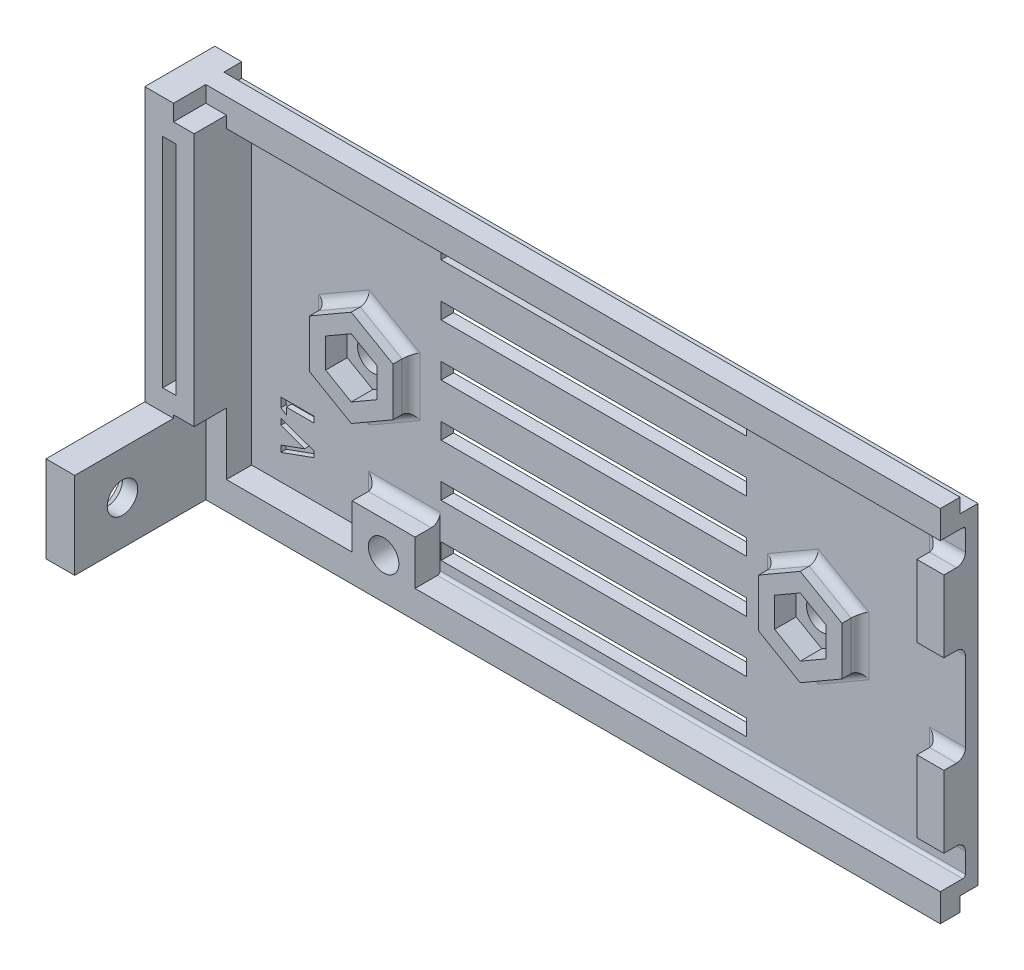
from build123d import *

# Parameters (mm, degrees)
SKETCH1_W                                       = 82.8
SKETCH1_H                                       = 40.05
BOSS_EXTRUDE1_DEPTH                             = 1.4
SKETCH5_W                                       = 2.2
SKETCH5_H                                       = 40.05
BOSS_EXTRUDE3_DEPTH                             = 7.8
SKETCH7_W                                       = 34
SKETCH7_H                                       = 1.8
CUT_EXTRUDE1_DEPTH                              = 2
SKETCH11_W                                      = 85
SKETCH11_H                                      = 3.1
BOSS_EXTRUDE4_DEPTH                             = 2.8
SKETCH9_W                                       = 85
SKETCH9_H                                       = 1.6
CUT_EXTRUDE4_DEPTH                              = 2
CSK_FOR_M3_FLAT_HEAD_MACHINE_SCREW1_D           = 3.4
CSK_FOR_M3_FLAT_HEAD_MACHINE_SCREW1_DEPTH       = 14
CSK_FOR_M3_FLAT_HEAD_MACHINE_SCREW1_CSINK_D     = 6
CSK_FOR_M3_FLAT_HEAD_MACHINE_SCREW1_CSINK_ANGLE = 90
CSK_FOR_M3_FLAT_HEAD_MACHINE_SCREW1_TIP         = 1.021463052
BOSS_EXTRUDE7_REACH                             = 77.059
SKETCH18_W                                      = 3.5
SKETCH18_H                                      = 40.05
FILLET2_R                                       = 0.3
BOSS_EXTRUDE8_START                             = 2.8
SKETCH25_W                                      = 7
SKETCH25_H                                      = 5.45
SKETCH25_R                                      = 1.7
BOSS_EXTRUDE8_DEPTH                             = 2.8
SKETCH23_W                                      = 2.3
SKETCH23_H                                      = 1.8
SKETCH23_H_2                                    = 10
CUT_EXTRUDE11_DEPTH                             = 3.6
SKETCH26_W                                      = 3.5
SKETCH26_H                                      = 1.6
CUT_EXTRUDE12_DEPTH                             = 0.6
SKETCH30_W                                      = 1.5
SKETCH30_H                                      = 24.25
CUT_EXTRUDE16_DEPTH                             = 6.4
SKETCH31_R                                      = 1.7
CUT_EXTRUDE17_DEPTH                             = 1.6
CUT_EXTRUDE18_DEPTH                             = 0.4
EXTRUDE_THIN1_DEPTH                             = 2.4
FILLET3_R                                       = 1
SKETCH34_W                                      = 3
SKETCH34_H                                      = 8
BOSS_EXTRUDE9_DEPTH                             = 2.4
FILLET4_R                                       = 1
SKETCH36_W                                      = 2
SKETCH36_H                                      = 1.6
BOSS_EXTRUDE11_DEPTH                            = 3
SKETCH37_W                                      = 3.2
SKETCH37_H                                      = 9.65
BOSS_EXTRUDE12_DEPTH                            = 11
SKETCH38_R                                      = 1.7
CUT_EXTRUDE19_DEPTH                             = 5
CSK_FOR_M3_FLAT_HEAD_MACHINE_SCREW2_D           = 3.4
CSK_FOR_M3_FLAT_HEAD_MACHINE_SCREW2_DEPTH       = 14
CSK_FOR_M3_FLAT_HEAD_MACHINE_SCREW2_CSINK_D     = 6.4
CSK_FOR_M3_FLAT_HEAD_MACHINE_SCREW2_CSINK_ANGLE = 90
CSK_FOR_M3_FLAT_HEAD_MACHINE_SCREW2_TIP         = 1.021463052
CUT_EXTRUDE20_DEPTH                             = 0.6


with BuildPart() as part:
    # Sketch1 → Boss-Extrude1 (new body)
    with BuildSketch(Plane.XY):
        with Locations((25.65, -13.1)):
            Rectangle(SKETCH1_W, SKETCH1_H)
    extrude(amount=BOSS_EXTRUDE1_DEPTH)

    # Sketch5 → Boss-Extrude3 (add)
    with BuildSketch(Plane.XY):
        with Locations((-16.85, -13.1)):
            Rectangle(SKETCH5_W, SKETCH5_H)
    extrude(amount=BOSS_EXTRUDE3_DEPTH)

    # Sketch7 → Cut-Extrude1 (cut)
    with BuildSketch(Plane.XY):
        with Locations((25.65, -4.575)):
            Rectangle(SKETCH7_W, SKETCH7_H)
        with Locations((25.65, 1.225)):
            Rectangle(SKETCH7_W, SKETCH7_H)
        with Locations((25.65, -21.975)):
            Rectangle(SKETCH7_W, SKETCH7_H)
        with Locations((25.65, -10.375)):
            Rectangle(SKETCH7_W, SKETCH7_H)
        with Locations((25.65, -16.175)):
            Rectangle(SKETCH7_W, SKETCH7_H)
        with Locations((25.65, -27.775)):
            Rectangle(SKETCH7_W, SKETCH7_H)
    extrude(amount=CUT_EXTRUDE1_DEPTH, mode=Mode.SUBTRACT)

    # Sketch11 → Boss-Extrude4 (add)
    with BuildSketch(Plane.XY.offset(1.4)):
        with Locations((24.55, -31.575)):
            Rectangle(SKETCH11_W, SKETCH11_H)
        with Locations((24.55, 5.375)):
            Rectangle(SKETCH11_W, SKETCH11_H)
    extrude(amount=BOSS_EXTRUDE4_DEPTH)

    # Sketch9 → Cut-Extrude4 (cut)
    with BuildSketch(Plane.XY):
        with Locations((24.55, -32.325)):
            Rectangle(SKETCH9_W, SKETCH9_H)
        with Locations((24.55, 6.125)):
            Rectangle(SKETCH9_W, SKETCH9_H)
    extrude(amount=CUT_EXTRUDE4_DEPTH, mode=Mode.SUBTRACT)

    # CSK for M3 Flat Head Machine Screw1
    with Locations(Plane(origin=(0, 0, 0), x_dir=(-1, 0, 0), z_dir=(0, 0, -1))):
        with Locations((-5.05, -28.575)):
            CounterSinkHole(CSK_FOR_M3_FLAT_HEAD_MACHINE_SCREW1_D / 2, CSK_FOR_M3_FLAT_HEAD_MACHINE_SCREW1_CSINK_D / 2, depth=CSK_FOR_M3_FLAT_HEAD_MACHINE_SCREW1_DEPTH, counter_sink_angle=CSK_FOR_M3_FLAT_HEAD_MACHINE_SCREW1_CSINK_ANGLE)
            with Locations((0, 0, -(CSK_FOR_M3_FLAT_HEAD_MACHINE_SCREW1_DEPTH + CSK_FOR_M3_FLAT_HEAD_MACHINE_SCREW1_TIP / 2))):  # 118° drill point
                Cone(0, CSK_FOR_M3_FLAT_HEAD_MACHINE_SCREW1_D / 2, CSK_FOR_M3_FLAT_HEAD_MACHINE_SCREW1_TIP, mode=Mode.SUBTRACT)

    # Boss-Extrude7: up to this face of the body (flat: up to its plane)
    boss_extrude7_end = Plane(part.part.faces().sort_by_distance((-16.85, -13.1, 7.8))[0])
    # Sketch18 → Boss-Extrude7 (add, up to the picked face)
    with BuildSketch(Plane.XY.offset(1.4), mode=Mode.PRIVATE) as boss_extrude7_sk1:
        with Locations((-14.2, -13.1)):
            Rectangle(SKETCH18_W, SKETCH18_H)
    boss_extrude7_tool1 = split(extrude(boss_extrude7_sk1.sketch, amount=BOSS_EXTRUDE7_REACH, mode=Mode.PRIVATE), bisect_by=boss_extrude7_end, keep=Keep.BOTH, mode=Mode.PRIVATE)
    add(boss_extrude7_tool1.solids().sort_by(Axis((-14.2, -13.1, 1.4), (0, 0, 1)))[0])

    # Fillet2
    fillet2_edges = [part.edges().sort_by_distance(p)[0] for p in [
        (36.493705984, -30.025, 1.4),
        (27.3, 3.825, 1.4),
    ]]
    fillet(fillet2_edges, radius=FILLET2_R)

    # Sketch25 → Boss-Extrude8 (add)
    with BuildSketch(Plane.XY.offset(1.4).offset(BOSS_EXTRUDE8_START)):
        with Locations((5.05, -27.8)):
            Rectangle(SKETCH25_W, SKETCH25_H)
        with Locations(Location((5.05, -28.575, 0), (0, 0, 180))):
            Circle(SKETCH25_R, mode=Mode.SUBTRACT)
    extrude(amount=-BOSS_EXTRUDE8_DEPTH)

    # Sketch23 → Cut-Extrude11 (cut)
    with BuildSketch(Plane.XY.offset(7.8)):
        with Locations((-13.6, 6.025)):
            Rectangle(SKETCH23_W, SKETCH23_H)
        with Locations((-13.6, -28.125)):
            Rectangle(SKETCH23_W, SKETCH23_H_2)
    extrude(amount=-CUT_EXTRUDE11_DEPTH, mode=Mode.SUBTRACT)

    # Sketch26 → Cut-Extrude12 (cut)
    with BuildSketch(Plane.XY.offset(1.4)):
        with Locations((-14.2, 6.125)):
            Rectangle(SKETCH26_W, SKETCH26_H)
        with Locations((-14.2, -32.325)):
            Rectangle(SKETCH26_W, SKETCH26_H)
    extrude(amount=CUT_EXTRUDE12_DEPTH, mode=Mode.SUBTRACT)

    # Sketch30 → Cut-Extrude16 (cut)
    with BuildSketch(Plane.XY.offset(7.8)):
        with Locations((-15.2, -9)):
            Rectangle(SKETCH30_W, SKETCH30_H)
    extrude(amount=-CUT_EXTRUDE16_DEPTH, mode=Mode.SUBTRACT)

    # Sketch31 → Cut-Extrude17 (cut)
    with BuildSketch(Plane.XY):
        with Locations((0.65, -13.1)):
            Circle(SKETCH31_R)
        with Locations((50.65, -13.1)):
            Circle(SKETCH31_R)
    extrude(amount=CUT_EXTRUDE17_DEPTH, mode=Mode.SUBTRACT)

    # Sketch32 → Cut-Extrude18 (cut)
    with BuildSketch(Plane(origin=(0, 0, 1), x_dir=(-1, 0, 0), z_dir=(0, 0, -1))):
        Polygon((-0.65, -16.390896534), (2.2, -14.745448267), (2.2, -11.454551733), (-0.65, -9.809103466), (-3.5, -11.454551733), (-3.5, -14.745448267), align=None)
        Polygon((-53.5, -14.745448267), (-50.65, -16.390896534), (-47.8, -14.745448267), (-47.8, -11.454551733), (-50.65, -9.809103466), (-53.5, -11.454551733), align=None)
    extrude(amount=-CUT_EXTRUDE18_DEPTH, mode=Mode.SUBTRACT)

    # Sketch33 → Extrude-Thin1 (add)
    # profile 1 of 2: a face of its own
    with BuildSketch(Plane(origin=(0, 0, 1), x_dir=(-1, 0, 0), z_dir=(0, 0, -1))):
        Polygon((-5.3, -10.415321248), (-5.3, -15.784678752), (-0.65, -18.469357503), (4, -15.784678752), (4, -10.415321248), (-0.65, -7.730642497), align=None)
        Polygon((-3.5, -11.454551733), (-3.5, -14.745448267), (-0.65, -16.390896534), (2.2, -14.745448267), (2.2, -11.454551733), (-0.65, -9.809103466), align=None, mode=Mode.SUBTRACT)
    # profile 2 of 2: a face of its own
    with BuildSketch(Plane(origin=(0, 0, 1), x_dir=(-1, 0, 0), z_dir=(0, 0, -1))):
        Polygon((-55.3, -10.415321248), (-55.3, -15.784678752), (-50.65, -18.469357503), (-46, -15.784678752), (-46, -10.415321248), (-50.65, -7.730642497), align=None)
        Polygon((-53.5, -11.454551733), (-53.5, -14.745448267), (-50.65, -16.390896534), (-47.8, -14.745448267), (-47.8, -11.454551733), (-50.65, -9.809103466), align=None, mode=Mode.SUBTRACT)
    extrude(amount=-EXTRUDE_THIN1_DEPTH)

    # Fillet3
    fillet3_edges = [part.edges().sort_by_distance(p)[0] for p in [
        (1.55, -27.55, 1.4),
        (5.05, -25.075, 1.4),
        (5.3, -13.1, 1.4),
        (2.975, -17.127018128, 1.4),
        (-1.675, -17.127018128, 1.4),
        (-4, -13.1, 1.4),
        (-1.675, -9.072981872, 1.4),
        (2.975, -9.072981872, 1.4),
        (55.3, -13.1, 1.4),
        (52.975, -17.127018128, 1.4),
        (48.325, -17.127018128, 1.4),
        (46, -13.1, 1.4),
        (48.325, -9.072981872, 1.4),
        (52.975, -9.072981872, 1.4),
    ]]
    fillet(fillet3_edges, radius=FILLET3_R)

    # Sketch34 → Boss-Extrude9 (add)
    with BuildSketch(Plane.XY.offset(1.4)):
        with Locations((65.55, -22.525)):
            Rectangle(SKETCH34_W, SKETCH34_H)
        with Locations((65.55, -3.675)):
            Rectangle(SKETCH34_W, SKETCH34_H)
    extrude(amount=BOSS_EXTRUDE9_DEPTH)

    # Fillet4
    fillet4_edges = [part.edges().sort_by_distance(p)[0] for p in [
        (65.55, -18.525, 1.4),
        (64.05, -22.525, 1.4),
        (65.55, -26.525, 1.4),
        (65.55, 0.325, 1.4),
        (64.05, -3.675, 1.4),
        (65.55, -7.675, 1.4),
    ]]
    fillet(fillet4_edges, radius=FILLET4_R)

    # Sketch36 → Boss-Extrude11 (add)
    with BuildSketch(Plane.ZY.offset(17.95)):
        with Locations((1, 6.125)):
            Rectangle(SKETCH36_W, SKETCH36_H)
        with Locations((1, -32.325)):
            Rectangle(SKETCH36_W, SKETCH36_H)
    extrude(amount=-BOSS_EXTRUDE11_DEPTH)

    # Sketch37 → Boss-Extrude12 (add)
    with BuildSketch(Plane.XY.offset(7.8)):
        with Locations((-16.35, -28.3)):
            Rectangle(SKETCH37_W, SKETCH37_H)
    extrude(amount=BOSS_EXTRUDE12_DEPTH)

    # Sketch38 → Cut-Extrude19 (cut)
    with BuildSketch(Plane.ZY.offset(17.95)):
        with Locations(Location((13.483161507, -28.275, 0), (0, 0, 270))):
            Circle(SKETCH38_R)
    extrude(amount=-CUT_EXTRUDE19_DEPTH, mode=Mode.SUBTRACT)

    # CSK for M3 Flat Head Machine Screw2
    with Locations(Plane.ZY.offset(17.95)):
        with Locations((13.483161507, -28.275)):
            CounterSinkHole(CSK_FOR_M3_FLAT_HEAD_MACHINE_SCREW2_D / 2, CSK_FOR_M3_FLAT_HEAD_MACHINE_SCREW2_CSINK_D / 2, depth=CSK_FOR_M3_FLAT_HEAD_MACHINE_SCREW2_DEPTH, counter_sink_angle=CSK_FOR_M3_FLAT_HEAD_MACHINE_SCREW2_CSINK_ANGLE)
            with Locations((0, 0, -(CSK_FOR_M3_FLAT_HEAD_MACHINE_SCREW2_DEPTH + CSK_FOR_M3_FLAT_HEAD_MACHINE_SCREW2_TIP / 2))):  # 118° drill point
                Cone(0, CSK_FOR_M3_FLAT_HEAD_MACHINE_SCREW2_D / 2, CSK_FOR_M3_FLAT_HEAD_MACHINE_SCREW2_TIP, mode=Mode.SUBTRACT)

    # Sketch41 → Cut-Extrude20 (cut)
    with BuildSketch(Plane.XY.offset(1.4)):
        Polygon((-9.197248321, -27.178364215), (-9.197248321, -26.468250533), (-6.566043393, -25.516238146), (-9.197248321, -24.561999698), (-9.197248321, -23.854112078), (-5.493081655, -25.197169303), (-5.493081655, -25.837533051), align=None)
        Polygon((-9.197248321, -22.863514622), (-9.197248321, -21.835816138), (-5.493081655, -21.835816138), (-5.493081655, -22.500666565), (-8.57988721, -22.500666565), (-8.57988721, -23.260495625), align=None)
    extrude(amount=-CUT_EXTRUDE20_DEPTH, mode=Mode.SUBTRACT)


solid = part.part
